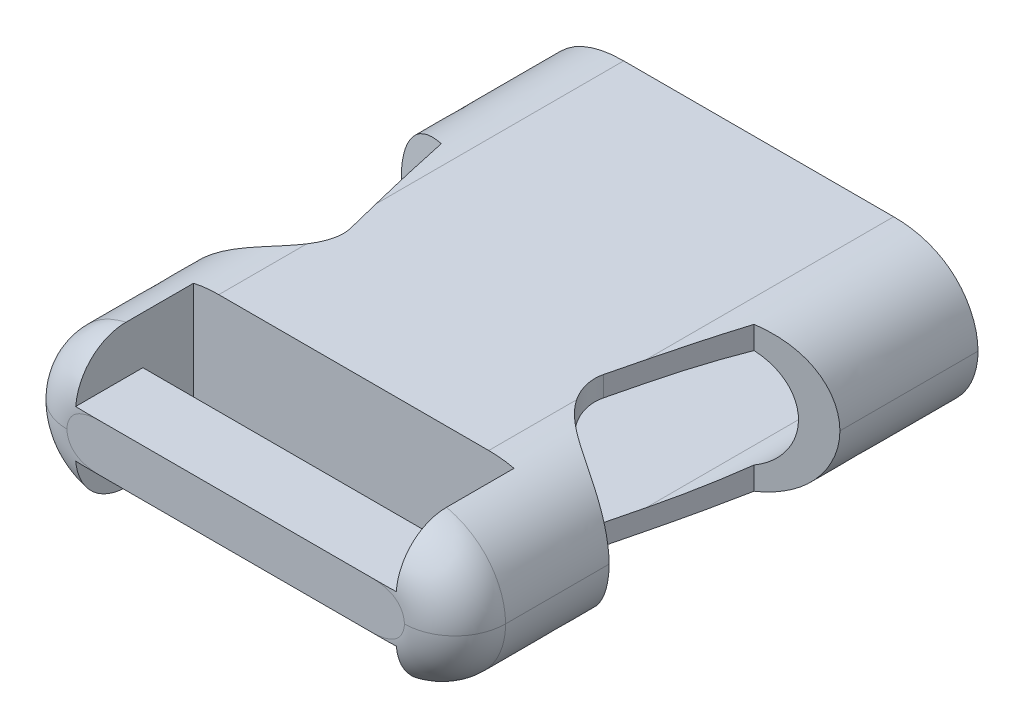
from build123d import *

# Parameters (mm, degrees)
ESTRUSIONE_ESTRUSIONE1_DEPTH = 31
TAGLIO_ESTRUSIONE1_DEPTH     = 10
SCHIZZO6_W                   = 19
SCHIZZO6_H                   = 3
TAGLIO_ESTRUSIONE2_DEPTH     = 10
RACCORDO1_R                  = 3
TAGLIO_ESTRUSIONE3_START     = 26
SCHIZZO7_W                   = 19
SCHIZZO7_H                   = 6.991675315
TAGLIO_ESTRUSIONE3_DEPTH     = 10
TAGLIO_ESTRUSIONE4_DEPTH     = 19.5
SCHIZZO10_W                  = 1.5
SCHIZZO10_H                  = 2
ESTRUSIONE_ESTRUSIONE2_DEPTH = 19.5


with BuildPart() as part:
    # Schizzo1 → Estrusione-Estrusione1 (new body)
    with BuildSketch(Plane.XY):
        with BuildLine():
            Line((-8, 4.4), (8, 4.4))
            add(Edge.make_bspline(
                [(13, 0), (13.003903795, 1.969833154), (11.538569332, 4.4), (8, 4.4)],
                knots=[0, 0, 0, 0, 1, 1, 1, 1], degree=3))
            add(Edge.make_bspline(
                [(13, 0), (13.003903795, -1.969833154), (11.538569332, -4.4), (8, -4.4)],
                knots=[0, 0, 0, 0, 1, 1, 1, 1], degree=3))
            Line((8, -4.4), (-8, -4.4))
            add(Edge.make_bspline(
                [(-13, 0), (-13.003903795, -1.969833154), (-11.538569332, -4.4), (-8, -4.4)],
                knots=[0, 0, 0, 0, 1, 1, 1, 1], degree=3))
            add(Edge.make_bspline(
                [(-13, 0), (-13.003903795, 1.969833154), (-11.538569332, 4.4), (-8, 4.4)],
                knots=[0, 0, 0, 0, 1, 1, 1, 1], degree=3))
        make_face()
    extrude(amount=ESTRUSIONE_ESTRUSIONE1_DEPTH)

    # Schizzo5 → Taglio-Estrusione1 (cut)
    with BuildSketch(Plane(origin=(0, 4.4, 0), x_dir=(1, 0, 0), z_dir=(0, 1, 0))):
        with BuildLine():
            Line((-13.506603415, -8), (-9.270342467, -9.54187289))
            Line((-9.270342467, -9.54187289), (-7.5, -16.700625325))
            add(Edge.make_bspline(
                [(-7.5, -16.700625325), (-7.118800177, -18.242087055), (-8.715069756, -20.815742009), (-13.506603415, -22)],
                knots=[0, 0, 0, 0, 1, 1, 1, 1], degree=3))
            Line((-13.506603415, -22), (-16.080277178, -22))
            Line((-16.080277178, -22), (-16.080277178, -8))
            Line((-16.080277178, -8), (-13.506603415, -8))
        make_face()
        with BuildLine():
            Line((16.080277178, -22), (13.506603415, -22))
            add(Edge.make_bspline(
                [(7.5, -16.700625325), (7.118800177, -18.242087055), (8.715069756, -20.815742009), (13.506603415, -22)],
                knots=[0, 0, 0, 0, 1, 1, 1, 1], degree=3))
            Line((7.5, -16.700625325), (9.270342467, -9.54187289))
            Line((9.270342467, -9.54187289), (13.506603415, -8))
            Line((13.506603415, -8), (16.080277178, -8))
            Line((16.080277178, -8), (16.080277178, -22))
        make_face()
    extrude(amount=-TAGLIO_ESTRUSIONE1_DEPTH, mode=Mode.SUBTRACT)

    # Schizzo6 → Taglio-Estrusione2 (cut)
    with BuildSketch(Plane(origin=(0, 4.4, 0), x_dir=(1, 0, 0), z_dir=(0, 1, 0))):
        with Locations((0, -25.5)):
            Rectangle(SCHIZZO6_W, SCHIZZO6_H)
    extrude(amount=-TAGLIO_ESTRUSIONE2_DEPTH, mode=Mode.SUBTRACT)

    # Raccordo1
    raccordo1_edges = [part.edges().sort_by_distance(p)[0] for p in [
        (0, -4.4, 31),
        (11.473177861, -3.27308915, 31),
        (11.473177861, 3.27308915, 31),
        (0, 4.4, 31),
        (-11.473177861, 3.27308915, 31),
        (-11.473177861, -3.27308915, 31),
    ]]
    fillet(raccordo1_edges, radius=RACCORDO1_R)

    # Schizzo7 → Taglio-Estrusione3 (cut)
    with BuildSketch(Plane.XY.offset(TAGLIO_ESTRUSIONE3_START)):
        with Locations((0, -4.895837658)):
            Rectangle(SCHIZZO7_W, SCHIZZO7_H)
        with Locations((0, 4.895837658)):
            Rectangle(SCHIZZO7_W, SCHIZZO7_H)
    extrude(amount=TAGLIO_ESTRUSIONE3_DEPTH, mode=Mode.SUBTRACT)

    # Schizzo9 → Taglio-Estrusione4 (cut)
    with BuildSketch(Plane(origin=(0, 0, 0), x_dir=(-1, 0, 0), z_dir=(0, 0, -1))):
        with BuildLine():
            Line((8, -3.2), (-8, -3.2))
            ThreePointArc((-8, -3.2), (-11.2, 0), (-8, 3.2))
            Line((-8, 3.2), (8, 3.2))
            ThreePointArc((8, 3.2), (11.2, 0), (8, -3.2))
        make_face()
    extrude(amount=-TAGLIO_ESTRUSIONE4_DEPTH, mode=Mode.SUBTRACT)

    # Schizzo10 → Estrusione-Estrusione2 (add)
    with BuildSketch(Plane(origin=(0, 0, 0), x_dir=(-1, 0, 0), z_dir=(0, 0, -1))):
        with Locations((-3.35, 2.2)):
            Rectangle(SCHIZZO10_W, SCHIZZO10_H)
        with Locations((3.35, 2.2)):
            Rectangle(SCHIZZO10_W, SCHIZZO10_H)
    extrude(amount=-ESTRUSIONE_ESTRUSIONE2_DEPTH)


solid = part.part
